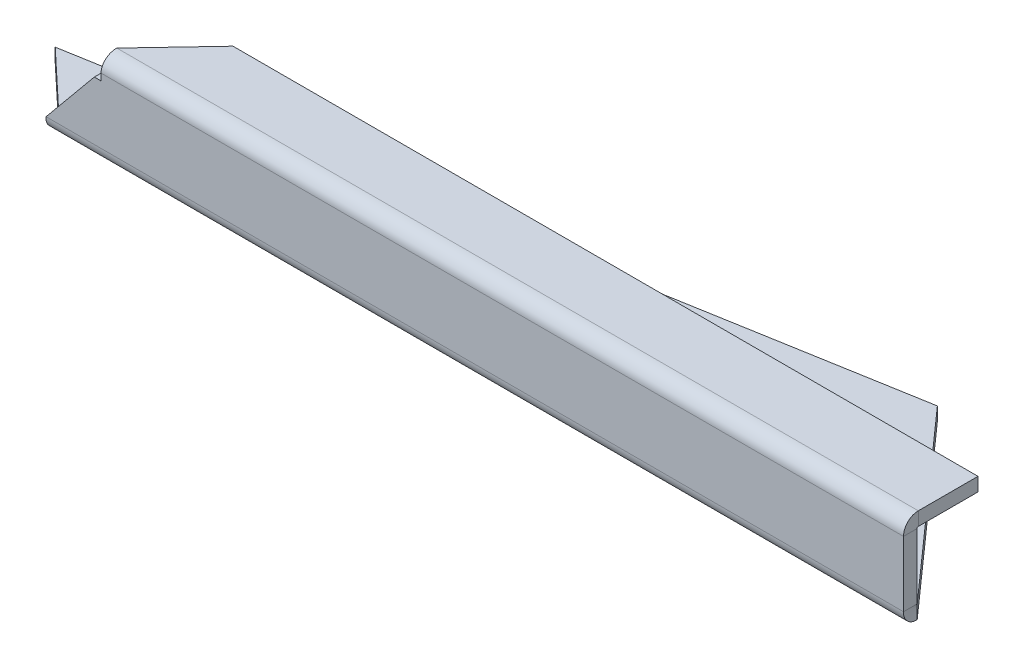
ISO-10303-21;
HEADER;
FILE_DESCRIPTION(('STEP AP214'),'2;1');
FILE_NAME('part.step','',(''),(''),'','','');
FILE_SCHEMA(('AUTOMOTIVE_DESIGN { 1 0 10303 214 1 1 1 1 }'));
ENDSEC;
DATA;
#1=APPLICATION_CONTEXT('core data for automotive mechanical design processes');
#2=APPLICATION_PROTOCOL_DEFINITION('international standard','automotive_design',2000,#1);
#3=PRODUCT_CONTEXT('',#1,'mechanical');
#4=PRODUCT('Part','Part','',(#3));
#5=PRODUCT_RELATED_PRODUCT_CATEGORY('part','',(#4));
#6=PRODUCT_DEFINITION_FORMATION('','',#4);
#7=PRODUCT_DEFINITION_CONTEXT('part definition',#1,'design');
#8=PRODUCT_DEFINITION('design','',#6,#7);
#9=PRODUCT_DEFINITION_SHAPE('','',#8);
#10=(LENGTH_UNIT() NAMED_UNIT(*) SI_UNIT(.MILLI.,.METRE.));
#11=(NAMED_UNIT(*) PLANE_ANGLE_UNIT() SI_UNIT($,.RADIAN.));
#12=(NAMED_UNIT(*) SI_UNIT($,.STERADIAN.) SOLID_ANGLE_UNIT());
#13=UNCERTAINTY_MEASURE_WITH_UNIT(LENGTH_MEASURE(1.E-05),#10,'distance_accuracy_value','');
#14=(GEOMETRIC_REPRESENTATION_CONTEXT(3) GLOBAL_UNCERTAINTY_ASSIGNED_CONTEXT((#13)) GLOBAL_UNIT_ASSIGNED_CONTEXT((#10,
#11,#12)) REPRESENTATION_CONTEXT('',''));
#15=CARTESIAN_POINT('',(0.,0.,0.));
#16=DIRECTION('',(0.,0.,1.));
#17=DIRECTION('',(1.,0.,0.));
#18=AXIS2_PLACEMENT_3D('',#15,#16,#17);
#19=CARTESIAN_POINT('',(-474.,40.,8.));
#20=DIRECTION('',(0.771373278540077,-0.636382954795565,0.));
#21=DIRECTION('',(0.636382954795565,0.771373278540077,0.));
#22=AXIS2_PLACEMENT_3D('',#19,#20,#21);
#23=PLANE('',#22);
#24=DIRECTION('',(0.,0.,1.));
#25=VECTOR('',#24,1.);
#26=CARTESIAN_POINT('',(-506.392305,0.736599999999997,0.));
#27=LINE('',#26,#25);
#28=CARTESIAN_POINT('',(-506.392305,0.736599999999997,0.));
#29=VERTEX_POINT('',#28);
#30=CARTESIAN_POINT('',(-506.392305,0.736600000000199,8.00000000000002));
#31=VERTEX_POINT('',#30);
#32=EDGE_CURVE('E175',#29,#31,#27,.T.);
#33=ORIENTED_EDGE('',*,*,#32,.T.);
#34=DIRECTION('',(-0.636382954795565,-0.771373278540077,0.));
#35=VECTOR('',#34,1.);
#36=CARTESIAN_POINT('',(-474.,40.,8.));
#37=LINE('',#36,#35);
#38=CARTESIAN_POINT('',(-477.907695,35.2634,8.));
#39=VERTEX_POINT('',#38);
#40=EDGE_CURVE('E38',#39,#31,#37,.T.);
#41=ORIENTED_EDGE('',*,*,#40,.F.);
#42=DIRECTION('',(0.,0.,1.));
#43=VECTOR('',#42,1.);
#44=CARTESIAN_POINT('',(-477.907695,35.2634,8.));
#45=LINE('',#44,#43);
#46=CARTESIAN_POINT('',(-477.907695,35.2634,0.));
#47=VERTEX_POINT('',#46);
#48=EDGE_CURVE('E330',#47,#39,#45,.T.);
#49=ORIENTED_EDGE('',*,*,#48,.F.);
#50=DIRECTION('',(-0.636382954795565,-0.771373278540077,0.));
#51=VECTOR('',#50,1.);
#52=CARTESIAN_POINT('',(-474.,40.,0.));
#53=LINE('',#52,#51);
#54=EDGE_CURVE('E329',#47,#29,#53,.T.);
#55=ORIENTED_EDGE('',*,*,#54,.T.);
#56=EDGE_LOOP('',(#33,#41,#49,#55));
#57=FACE_BOUND('',#56,.T.);
#58=ADVANCED_FACE('F31',(#57),#23,.F.);
#59=CARTESIAN_POINT('',(0.,0.,8.));
#60=DIRECTION('',(-1.,0.,0.));
#61=DIRECTION('',(0.,0.,1.));
#62=AXIS2_PLACEMENT_3D('',#59,#60,#61);
#63=PLANE('',#62);
#64=DIRECTION('',(0.,0.,1.));
#65=VECTOR('',#64,1.);
#66=CARTESIAN_POINT('',(0.,0.736600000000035,0.));
#67=LINE('',#66,#65);
#68=CARTESIAN_POINT('',(0.,0.736600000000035,0.));
#69=VERTEX_POINT('',#68);
#70=CARTESIAN_POINT('',(0.,0.736600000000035,8.));
#71=VERTEX_POINT('',#70);
#72=EDGE_CURVE('E172',#69,#71,#67,.T.);
#73=ORIENTED_EDGE('',*,*,#72,.F.);
#74=DIRECTION('',(0.,1.,0.));
#75=VECTOR('',#74,1.);
#76=CARTESIAN_POINT('',(0.,0.,0.));
#77=LINE('',#76,#75);
#78=CARTESIAN_POINT('',(0.,39.2634,0.));
#79=VERTEX_POINT('',#78);
#80=EDGE_CURVE('E314',#69,#79,#77,.T.);
#81=ORIENTED_EDGE('',*,*,#80,.T.);
#82=DIRECTION('',(0.,0.,1.));
#83=VECTOR('',#82,1.);
#84=CARTESIAN_POINT('',(0.,39.2634,0.));
#85=LINE('',#84,#83);
#86=CARTESIAN_POINT('',(0.,39.2634000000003,7.99999999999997));
#87=VERTEX_POINT('',#86);
#88=EDGE_CURVE('E355',#79,#87,#85,.T.);
#89=ORIENTED_EDGE('',*,*,#88,.T.);
#90=DIRECTION('',(0.,1.,0.));
#91=VECTOR('',#90,1.);
#92=CARTESIAN_POINT('',(0.,0.,8.));
#93=LINE('',#92,#91);
#94=EDGE_CURVE('E11',#71,#87,#93,.T.);
#95=ORIENTED_EDGE('',*,*,#94,.F.);
#96=EDGE_LOOP('',(#73,#81,#89,#95));
#97=FACE_BOUND('',#96,.T.);
#98=ADVANCED_FACE('F302',(#97),#63,.F.);
#99=CARTESIAN_POINT('',(-507.,0.,8.));
#100=DIRECTION('',(0.,0.,1.));
#101=DIRECTION('',(1.,0.,0.));
#102=AXIS2_PLACEMENT_3D('',#99,#100,#101);
#103=PLANE('',#102);
#104=ORIENTED_EDGE('',*,*,#40,.T.);
#105=DIRECTION('',(-1.,0.,0.));
#106=VECTOR('',#105,1.);
#107=CARTESIAN_POINT('',(-507.784122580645,0.736600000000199,8.00000000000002));
#108=LINE('',#107,#106);
#109=EDGE_CURVE('E168',#31,#71,#108,.F.);
#110=ORIENTED_EDGE('',*,*,#109,.T.);
#111=ORIENTED_EDGE('',*,*,#94,.T.);
#112=DIRECTION('',(1.,0.,0.));
#113=VECTOR('',#112,1.);
#114=CARTESIAN_POINT('',(0.,39.2634000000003,7.99999999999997));
#115=LINE('',#114,#113);
#116=CARTESIAN_POINT('',(-474.,39.2634,8.));
#117=VERTEX_POINT('',#116);
#118=EDGE_CURVE('E352',#87,#117,#115,.F.);
#119=ORIENTED_EDGE('',*,*,#118,.T.);
#120=DIRECTION('',(0.,-1.,0.));
#121=VECTOR('',#120,1.);
#122=CARTESIAN_POINT('',(-474.,0.,8.));
#123=LINE('',#122,#121);
#124=CARTESIAN_POINT('',(-474.,35.2634,8.));
#125=VERTEX_POINT('',#124);
#126=EDGE_CURVE('E333',#117,#125,#123,.T.);
#127=ORIENTED_EDGE('',*,*,#126,.T.);
#128=DIRECTION('',(-1.,0.,0.));
#129=VECTOR('',#128,1.);
#130=CARTESIAN_POINT('',(-507.,35.2634,8.));
#131=LINE('',#130,#129);
#132=EDGE_CURVE('E339',#125,#39,#131,.T.);
#133=ORIENTED_EDGE('',*,*,#132,.T.);
#134=EDGE_LOOP('',(#104,#110,#111,#119,#127,#133));
#135=FACE_BOUND('',#134,.T.);
#136=ADVANCED_FACE('F299',(#135),#103,.T.);
#137=CARTESIAN_POINT('',(-507.,0.,0.));
#138=DIRECTION('',(0.,0.,1.));
#139=DIRECTION('',(1.,0.,0.));
#140=AXIS2_PLACEMENT_3D('',#137,#138,#139);
#141=PLANE('',#140);
#142=DIRECTION('',(-1.,0.,0.));
#143=VECTOR('',#142,1.);
#144=CARTESIAN_POINT('',(-507.784122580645,0.736599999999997,0.));
#145=LINE('',#144,#143);
#146=EDGE_CURVE('E160',#29,#69,#145,.F.);
#147=ORIENTED_EDGE('',*,*,#146,.F.);
#148=ORIENTED_EDGE('',*,*,#54,.F.);
#149=DIRECTION('',(-1.,0.,0.));
#150=VECTOR('',#149,1.);
#151=CARTESIAN_POINT('',(-474.,35.2634,0.));
#152=LINE('',#151,#150);
#153=CARTESIAN_POINT('',(-474.,35.2634,0.));
#154=VERTEX_POINT('',#153);
#155=EDGE_CURVE('E343',#154,#47,#152,.T.);
#156=ORIENTED_EDGE('',*,*,#155,.F.);
#157=DIRECTION('',(0.,-1.,0.));
#158=VECTOR('',#157,1.);
#159=CARTESIAN_POINT('',(-474.,39.2634,0.));
#160=LINE('',#159,#158);
#161=CARTESIAN_POINT('',(-474.,39.2634,0.));
#162=VERTEX_POINT('',#161);
#163=EDGE_CURVE('E270',#162,#154,#160,.T.);
#164=ORIENTED_EDGE('',*,*,#163,.F.);
#165=DIRECTION('',(1.,0.,0.));
#166=VECTOR('',#165,1.);
#167=CARTESIAN_POINT('',(0.,39.2634,0.));
#168=LINE('',#167,#166);
#169=EDGE_CURVE('E265',#79,#162,#168,.F.);
#170=ORIENTED_EDGE('',*,*,#169,.F.);
#171=ORIENTED_EDGE('',*,*,#80,.F.);
#172=EDGE_LOOP('',(#147,#148,#156,#164,#170,#171));
#173=FACE_BOUND('',#172,.T.);
#174=ADVANCED_FACE('F292',(#173),#141,.F.);
#175=CARTESIAN_POINT('',(-474.,35.2634,0.));
#176=DIRECTION('',(0.,1.,0.));
#177=DIRECTION('',(0.,0.,1.));
#178=AXIS2_PLACEMENT_3D('',#175,#176,#177);
#179=PLANE('',#178);
#180=ORIENTED_EDGE('',*,*,#155,.T.);
#181=ORIENTED_EDGE('',*,*,#48,.T.);
#182=ORIENTED_EDGE('',*,*,#132,.F.);
#183=DIRECTION('',(0.,0.,1.));
#184=VECTOR('',#183,1.);
#185=CARTESIAN_POINT('',(-474.,35.2634,0.));
#186=LINE('',#185,#184);
#187=EDGE_CURVE('E341',#154,#125,#186,.T.);
#188=ORIENTED_EDGE('',*,*,#187,.F.);
#189=EDGE_LOOP('',(#180,#181,#182,#188));
#190=FACE_BOUND('',#189,.T.);
#191=ADVANCED_FACE('F289',(#190),#179,.T.);
#192=CARTESIAN_POINT('',(-474.,39.2634,0.));
#193=DIRECTION('',(-1.,0.,0.));
#194=DIRECTION('',(0.,0.,1.));
#195=AXIS2_PLACEMENT_3D('',#192,#193,#194);
#196=PLANE('',#195);
#197=ORIENTED_EDGE('',*,*,#126,.F.);
#198=DIRECTION('',(0.,0.,1.));
#199=VECTOR('',#198,1.);
#200=CARTESIAN_POINT('',(-474.,39.2634,0.));
#201=LINE('',#200,#199);
#202=EDGE_CURVE('E344',#162,#117,#201,.T.);
#203=ORIENTED_EDGE('',*,*,#202,.F.);
#204=ORIENTED_EDGE('',*,*,#163,.T.);
#205=ORIENTED_EDGE('',*,*,#187,.T.);
#206=EDGE_LOOP('',(#197,#203,#204,#205));
#207=FACE_BOUND('',#206,.T.);
#208=ADVANCED_FACE('F278',(#207),#196,.T.);
#209=CARTESIAN_POINT('',(-474.,39.2633999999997,8.07999999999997));
#210=CARTESIAN_POINT('',(-473.942016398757,40.4176978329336,8.08000000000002));
#211=CARTESIAN_POINT('',(-473.884053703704,41.5711263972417,7.85052750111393));
#212=CARTESIAN_POINT('',(-473.768107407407,43.7036071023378,6.96722507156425));
#213=CARTESIAN_POINT('',(-473.710134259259,44.6816126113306,6.3137426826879));
#214=CARTESIAN_POINT('',(-473.594187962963,46.3137426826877,4.68161261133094));
#215=CARTESIAN_POINT('',(-473.536214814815,46.9672250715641,3.70360710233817));
#216=CARTESIAN_POINT('',(-473.420268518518,47.8505275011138,1.57112639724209));
#217=CARTESIAN_POINT('',(-473.362305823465,48.0799999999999,0.417697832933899));
#218=CARTESIAN_POINT('',(-473.304322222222,48.0799999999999,-0.736599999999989));
#219=CARTESIAN_POINT('',(-474.,39.2633999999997,7.99999999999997));
#220=CARTESIAN_POINT('',(-473.942016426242,40.4072239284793,8.00000000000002));
#221=CARTESIAN_POINT('',(-473.884053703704,41.550186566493,7.77260968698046));
#222=CARTESIAN_POINT('',(-473.768107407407,43.6633175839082,6.89732216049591));
#223=CARTESIAN_POINT('',(-473.710134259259,44.6324488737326,6.24976933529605));
#224=CARTESIAN_POINT('',(-473.594187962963,46.2497693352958,4.63244887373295));
#225=CARTESIAN_POINT('',(-473.536214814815,46.8973221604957,3.66331758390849));
#226=CARTESIAN_POINT('',(-473.420268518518,47.7726096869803,1.55018656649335));
#227=CARTESIAN_POINT('',(-473.36230579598,48.,0.407223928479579));
#228=CARTESIAN_POINT('',(-473.304322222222,48.,-0.73659999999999));
#229=CARTESIAN_POINT('',(-474.,39.2634,0.));
#230=CARTESIAN_POINT('',(-473.942019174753,39.3598334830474,0.));
#231=CARTESIAN_POINT('',(-473.884053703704,39.456203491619,-0.0191717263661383));
#232=CARTESIAN_POINT('',(-473.768107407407,39.6343657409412,-0.0929689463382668));
#233=CARTESIAN_POINT('',(-473.710134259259,39.7160751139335,-0.147565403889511));
#234=CARTESIAN_POINT('',(-473.594187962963,39.8524345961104,-0.283924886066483));
#235=CARTESIAN_POINT('',(-473.536214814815,39.9070310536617,-0.365634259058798));
#236=CARTESIAN_POINT('',(-473.420268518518,39.9808282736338,-0.543796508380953));
#237=CARTESIAN_POINT('',(-473.362303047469,40.,-0.6401665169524));
#238=CARTESIAN_POINT('',(-473.304322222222,40.,-0.736599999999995));
#239=CARTESIAN_POINT('',(-474.,39.2634,-0.0808000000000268));
#240=CARTESIAN_POINT('',(-473.942019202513,39.3492548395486,-0.0808000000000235));
#241=CARTESIAN_POINT('',(-473.884053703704,39.4350542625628,-0.097868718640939));
#242=CARTESIAN_POINT('',(-473.768107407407,39.5936733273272,-0.163570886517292));
#243=CARTESIAN_POINT('',(-473.710134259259,39.6664197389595,-0.212178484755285));
#244=CARTESIAN_POINT('',(-473.594187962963,39.7878215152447,-0.333580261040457));
#245=CARTESIAN_POINT('',(-473.536214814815,39.8364291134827,-0.406326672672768));
#246=CARTESIAN_POINT('',(-473.420268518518,39.902131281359,-0.564945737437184));
#247=CARTESIAN_POINT('',(-473.362303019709,39.9192,-0.650745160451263));
#248=CARTESIAN_POINT('',(-473.304322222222,39.9192,-0.736599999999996));
#249=B_SPLINE_SURFACE_WITH_KNOTS('',1,3,((#209,#210,#211,#212,#213,#214,#215,#216,#217,#218),
(#219,#220,#221,#222,#223,#224,#225,#226,#227,#228),(#229,#230,#231,#232,#233,#234,#235,#236,
#237,#238),(#239,#240,#241,#242,#243,#244,#245,#246,#247,#248)),.UNSPECIFIED.,.F.,.F.,.F.,(2,1,
1,2),(4,2,2,2,4),(-0.01,0.,1.,1.0101),(0.,0.25,0.5,0.75,1.),.UNSPECIFIED.);
#250=DIRECTION('',(0.,1.,0.));
#251=VECTOR('',#250,1.);
#252=CARTESIAN_POINT('',(-473.304322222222,40.,-0.736599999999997));
#253=LINE('',#252,#251);
#254=CARTESIAN_POINT('',(-473.304322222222,40.,-0.736599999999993));
#255=VERTEX_POINT('',#254);
#256=CARTESIAN_POINT('',(-473.304322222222,48.,-0.736599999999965));
#257=VERTEX_POINT('',#256);
#258=EDGE_CURVE('E174',#255,#257,#253,.T.);
#259=CARTESIAN_POINT('',(-474.,39.2634,0.));
#260=CARTESIAN_POINT('',(-473.983783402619,39.290368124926,5.87050044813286E-07));
#261=CARTESIAN_POINT('',(-473.967578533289,39.3173199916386,-0.0014824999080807));
#262=CARTESIAN_POINT('',(-473.935169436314,39.3709002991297,-0.00738771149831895));
#263=CARTESIAN_POINT('',(-473.918965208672,39.3975287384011,-0.0118098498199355));
#264=CARTESIAN_POINT('',(-473.870417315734,39.4763333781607,-0.0294068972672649));
#265=CARTESIAN_POINT('',(-473.838040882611,39.5275950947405,-0.0469128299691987));
#266=CARTESIAN_POINT('',(-473.776567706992,39.6201555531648,-0.0903358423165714));
#267=CARTESIAN_POINT('',(-473.747467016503,39.6619379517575,-0.115235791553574));
#268=CARTESIAN_POINT('',(-473.689273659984,39.7398029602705,-0.172723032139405));
#269=CARTESIAN_POINT('',(-473.66018100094,39.7758892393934,-0.20530534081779));
#270=CARTESIAN_POINT('',(-473.602004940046,39.8409766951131,-0.276897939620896));
#271=CARTESIAN_POINT('',(-473.572921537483,39.8699787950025,-0.315907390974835));
#272=CARTESIAN_POINT('',(-473.514738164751,39.9197981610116,-0.398868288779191));
#273=CARTESIAN_POINT('',(-473.485638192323,39.940612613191,-0.442821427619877));
#274=CARTESIAN_POINT('',(-473.431165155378,39.9711399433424,-0.52812037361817));
#275=CARTESIAN_POINT('',(-473.405790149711,39.9819301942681,-0.569083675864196));
#276=CARTESIAN_POINT('',(-473.355053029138,39.996375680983,-0.6522256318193));
#277=CARTESIAN_POINT('',(-473.329690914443,40.0000346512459,-0.694403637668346));
#278=CARTESIAN_POINT('',(-473.304322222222,40.,-0.736599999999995));
#279=B_SPLINE_CURVE_WITH_KNOTS('',3,(#259,#260,#261,#262,#263,#264,#265,#266,#267,#268,#269,
#270,#271,#272,#273,#274,#275,#276,#277,#278),.UNSPECIFIED.,.F.,.F.,(4,2,2,2,2,2,2,2,2,4),(0.,
0.0943306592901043,0.188661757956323,0.376754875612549,0.546023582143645,0.715182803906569,
0.88431996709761,1.05351520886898,1.20112966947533,1.34866680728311),.UNSPECIFIED.);
#280=EDGE_CURVE('E257',#162,#255,#279,.T.);
#281=CARTESIAN_POINT('',(-474.,39.2633999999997,7.99999999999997));
#282=CARTESIAN_POINT('',(-473.987526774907,39.5094459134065,8.00002655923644));
#283=CARTESIAN_POINT('',(-473.975053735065,39.7554880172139,7.98960715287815));
#284=CARTESIAN_POINT('',(-473.950108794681,40.2458073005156,7.94806823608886));
#285=CARTESIAN_POINT('',(-473.937636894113,40.490084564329,7.91694972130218));
#286=CARTESIAN_POINT('',(-473.912703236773,40.9749573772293,7.83423568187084));
#287=CARTESIAN_POINT('',(-473.900241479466,41.2155555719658,7.78265566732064));
#288=CARTESIAN_POINT('',(-473.875317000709,41.6915432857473,7.65939485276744));
#289=CARTESIAN_POINT('',(-473.862854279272,41.9269328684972,7.5877142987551));
#290=CARTESIAN_POINT('',(-473.837922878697,42.3909407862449,7.424721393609));
#291=CARTESIAN_POINT('',(-473.82545419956,42.619555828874,7.33339966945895));
#292=CARTESIAN_POINT('',(-473.800516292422,43.0682720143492,7.13179417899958));
#293=CARTESIAN_POINT('',(-473.788047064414,43.2883729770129,7.02151001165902));
#294=CARTESIAN_POINT('',(-473.763112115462,43.7184467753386,6.78278923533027));
#295=CARTESIAN_POINT('',(-473.750646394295,43.9284214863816,6.65435600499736));
#296=CARTESIAN_POINT('',(-473.725714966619,44.3367889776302,6.38023775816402));
#297=CARTESIAN_POINT('',(-473.71324926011,44.5351818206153,6.23455283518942));
#298=CARTESIAN_POINT('',(-473.688316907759,44.9189696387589,5.92697152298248));
#299=CARTESIAN_POINT('',(-473.675850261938,45.1043648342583,5.76507540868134));
#300=CARTESIAN_POINT('',(-473.650917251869,45.4608399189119,5.42622336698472));
#301=CARTESIAN_POINT('',(-473.638450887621,45.6319198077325,5.2492674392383));
#302=CARTESIAN_POINT('',(-473.613515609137,45.9585791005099,4.88151847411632));
#303=CARTESIAN_POINT('',(-473.601046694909,46.1141552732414,4.69072256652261));
#304=CARTESIAN_POINT('',(-473.576110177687,46.4086552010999,4.29668970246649));
#305=CARTESIAN_POINT('',(-473.563642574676,46.5475792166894,4.09345294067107));
#306=CARTESIAN_POINT('',(-473.538703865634,46.8078155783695,3.67593839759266));
#307=CARTESIAN_POINT('',(-473.526232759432,46.9291240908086,3.46165822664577));
#308=CARTESIAN_POINT('',(-473.501290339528,47.1532261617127,3.02363249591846));
#309=CARTESIAN_POINT('',(-473.488819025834,47.2560200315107,2.79988709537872));
#310=CARTESIAN_POINT('',(-473.463881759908,47.4423191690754,2.34461931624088));
#311=CARTESIAN_POINT('',(-473.45141580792,47.5258335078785,2.11310065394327));
#312=CARTESIAN_POINT('',(-473.426489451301,47.6730192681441,1.64393590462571));
#313=CARTESIAN_POINT('',(-473.414029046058,47.7366955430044,1.4062913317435));
#314=CARTESIAN_POINT('',(-473.385348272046,47.8599210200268,0.854074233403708));
#315=CARTESIAN_POINT('',(-473.369125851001,47.912450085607,0.537890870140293));
#316=CARTESIAN_POINT('',(-473.344810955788,47.9649744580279,0.0611234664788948));
#317=CARTESIAN_POINT('',(-473.336713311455,47.9781043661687,-0.0981310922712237));
#318=CARTESIAN_POINT('',(-473.320518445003,47.995616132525,-0.417110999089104));
#319=CARTESIAN_POINT('',(-473.312421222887,47.9999985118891,-0.576836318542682));
#320=CARTESIAN_POINT('',(-473.304322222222,48.,-0.73659999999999));
#321=B_SPLINE_CURVE_WITH_KNOTS('',3,(#281,#282,#283,#284,#285,#286,#287,#288,#289,#290,#291,
#292,#293,#294,#295,#296,#297,#298,#299,#300,#301,#302,#303,#304,#305,#306,#307,#308,#309,#310,
#311,#312,#313,#314,#315,#316,#317,#318,#319,#320),.UNSPECIFIED.,.F.,.F.,(4,2,2,2,2,2,2,2,2,2,2,
2,2,2,2,2,2,2,2,4),(0.,0.738860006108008,1.47768447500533,2.21594997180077,2.95420643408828,
3.69281598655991,4.43144116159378,5.16992901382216,5.9084128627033,6.64688418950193,
7.38535553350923,8.12398046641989,8.86259384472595,9.60136772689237,10.3401291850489,
11.078542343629,11.8167747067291,12.7773671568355,13.257165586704,13.7369354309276),.UNSPECIFIED.);
#322=EDGE_CURVE('E53',#117,#257,#321,.T.);
#323=ORIENTED_EDGE('',*,*,#258,.F.);
#324=ORIENTED_EDGE('',*,*,#280,.F.);
#325=ORIENTED_EDGE('',*,*,#202,.T.);
#326=ORIENTED_EDGE('',*,*,#322,.T.);
#327=EDGE_LOOP('',(#323,#324,#325,#326));
#328=FACE_BOUND('',#327,.T.);
#329=ADVANCED_FACE('F272',(#328),#249,.F.);
#330=CARTESIAN_POINT('',(0.,39.2634,-0.736599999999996));
#331=DIRECTION('',(-1.,0.,0.));
#332=DIRECTION('',(0.,0.,1.));
#333=AXIS2_PLACEMENT_3D('',#330,#331,#332);
#334=PLANE('',#333);
#335=CARTESIAN_POINT('',(0.,39.2634,-0.736599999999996));
#336=DIRECTION('',(1.,0.,0.));
#337=DIRECTION('',(0.,0.,-1.));
#338=AXIS2_PLACEMENT_3D('',#335,#336,#337);
#339=CIRCLE('',#338,0.736599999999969);
#340=CARTESIAN_POINT('',(0.,40.,-0.736599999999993));
#341=VERTEX_POINT('',#340);
#342=EDGE_CURVE('E391',#341,#79,#339,.T.);
#343=ORIENTED_EDGE('',*,*,#342,.F.);
#344=DIRECTION('',(0.,1.,0.));
#345=VECTOR('',#344,1.);
#346=CARTESIAN_POINT('',(0.,40.,-0.73659999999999));
#347=LINE('',#346,#345);
#348=CARTESIAN_POINT('',(0.,48.,-0.736599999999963));
#349=VERTEX_POINT('',#348);
#350=EDGE_CURVE('E370',#341,#349,#347,.T.);
#351=ORIENTED_EDGE('',*,*,#350,.T.);
#352=CARTESIAN_POINT('',(0.,39.2634,-0.736599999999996));
#353=DIRECTION('',(1.,0.,0.));
#354=DIRECTION('',(0.,0.,-1.));
#355=AXIS2_PLACEMENT_3D('',#352,#353,#354);
#356=CIRCLE('',#355,8.73659999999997);
#357=EDGE_CURVE('E264',#349,#87,#356,.T.);
#358=ORIENTED_EDGE('',*,*,#357,.T.);
#359=ORIENTED_EDGE('',*,*,#88,.F.);
#360=EDGE_LOOP('',(#343,#351,#358,#359));
#361=FACE_BOUND('',#360,.T.);
#362=ADVANCED_FACE('F253',(#361),#334,.F.);
#363=CARTESIAN_POINT('',(0.,39.2634,-0.736599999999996));
#364=DIRECTION('',(1.,0.,0.));
#365=DIRECTION('',(0.,1.,0.));
#366=AXIS2_PLACEMENT_3D('',#363,#364,#365);
#367=CYLINDRICAL_SURFACE('',#366,8.73659999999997);
#368=ORIENTED_EDGE('',*,*,#118,.F.);
#369=ORIENTED_EDGE('',*,*,#357,.F.);
#370=DIRECTION('',(-1.,0.,0.));
#371=VECTOR('',#370,1.);
#372=CARTESIAN_POINT('',(0.,48.,-0.736599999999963));
#373=LINE('',#372,#371);
#374=EDGE_CURVE('E397',#349,#257,#373,.T.);
#375=ORIENTED_EDGE('',*,*,#374,.T.);
#376=ORIENTED_EDGE('',*,*,#322,.F.);
#377=EDGE_LOOP('',(#368,#369,#375,#376));
#378=FACE_BOUND('',#377,.T.);
#379=ADVANCED_FACE('F251',(#378),#367,.T.);
#380=CARTESIAN_POINT('',(0.,39.2634,-0.736599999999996));
#381=DIRECTION('',(1.,0.,0.));
#382=DIRECTION('',(0.,1.,0.));
#383=AXIS2_PLACEMENT_3D('',#380,#381,#382);
#384=CYLINDRICAL_SURFACE('',#383,0.736599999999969);
#385=ORIENTED_EDGE('',*,*,#169,.T.);
#386=ORIENTED_EDGE('',*,*,#280,.T.);
#387=DIRECTION('',(1.,0.,0.));
#388=VECTOR('',#387,1.);
#389=CARTESIAN_POINT('',(-473.304322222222,40.,-0.736599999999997));
#390=LINE('',#389,#388);
#391=EDGE_CURVE('E213',#255,#341,#390,.T.);
#392=ORIENTED_EDGE('',*,*,#391,.T.);
#393=ORIENTED_EDGE('',*,*,#342,.T.);
#394=EDGE_LOOP('',(#385,#386,#392,#393));
#395=FACE_BOUND('',#394,.T.);
#396=ADVANCED_FACE('F246',(#395),#384,.F.);
#397=CARTESIAN_POINT('',(0.,48.0000000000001,-35.9999999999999));
#398=DIRECTION('',(-1.,0.,0.));
#399=DIRECTION('',(0.,0.,1.));
#400=AXIS2_PLACEMENT_3D('',#397,#398,#399);
#401=PLANE('',#400);
#402=ORIENTED_EDGE('',*,*,#350,.F.);
#403=DIRECTION('',(0.,0.,-1.));
#404=VECTOR('',#403,1.);
#405=CARTESIAN_POINT('',(0.,40.0000000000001,-35.9999999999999));
#406=LINE('',#405,#404);
#407=CARTESIAN_POINT('',(0.,40.0000000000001,-35.9999999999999));
#408=VERTEX_POINT('',#407);
#409=EDGE_CURVE('E369',#341,#408,#406,.T.);
#410=ORIENTED_EDGE('',*,*,#409,.T.);
#411=DIRECTION('',(0.,-1.,0.));
#412=VECTOR('',#411,1.);
#413=CARTESIAN_POINT('',(0.,48.0000000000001,-35.9999999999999));
#414=LINE('',#413,#412);
#415=CARTESIAN_POINT('',(0.,48.0000000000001,-35.9999999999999));
#416=VERTEX_POINT('',#415);
#417=EDGE_CURVE('E388',#416,#408,#414,.T.);
#418=ORIENTED_EDGE('',*,*,#417,.F.);
#419=DIRECTION('',(0.,0.,-1.));
#420=VECTOR('',#419,1.);
#421=CARTESIAN_POINT('',(0.,48.0000000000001,-35.9999999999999));
#422=LINE('',#421,#420);
#423=EDGE_CURVE('E376',#349,#416,#422,.T.);
#424=ORIENTED_EDGE('',*,*,#423,.F.);
#425=EDGE_LOOP('',(#402,#410,#418,#424));
#426=FACE_BOUND('',#425,.T.);
#427=ADVANCED_FACE('F239',(#426),#401,.F.);
#428=CARTESIAN_POINT('',(-474.,48.,0.));
#429=DIRECTION('',(0.727013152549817,0.,0.686623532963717));
#430=DIRECTION('',(0.686623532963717,0.,-0.727013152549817));
#431=AXIS2_PLACEMENT_3D('',#428,#429,#430);
#432=PLANE('',#431);
#433=ORIENTED_EDGE('',*,*,#258,.T.);
#434=DIRECTION('',(-0.686623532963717,0.,0.727013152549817));
#435=VECTOR('',#434,1.);
#436=CARTESIAN_POINT('',(-474.,48.,0.));
#437=LINE('',#436,#435);
#438=CARTESIAN_POINT('',(-440.,48.0000000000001,-35.9999999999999));
#439=VERTEX_POINT('',#438);
#440=EDGE_CURVE('E385',#439,#257,#437,.T.);
#441=ORIENTED_EDGE('',*,*,#440,.F.);
#442=DIRECTION('',(0.,-1.,0.));
#443=VECTOR('',#442,1.);
#444=CARTESIAN_POINT('',(-440.,48.0000000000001,-35.9999999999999));
#445=LINE('',#444,#443);
#446=CARTESIAN_POINT('',(-440.,40.0000000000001,-35.9999999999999));
#447=VERTEX_POINT('',#446);
#448=EDGE_CURVE('E375',#439,#447,#445,.T.);
#449=ORIENTED_EDGE('',*,*,#448,.T.);
#450=DIRECTION('',(-0.686623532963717,0.,0.727013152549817));
#451=VECTOR('',#450,1.);
#452=CARTESIAN_POINT('',(-474.,40.,0.));
#453=LINE('',#452,#451);
#454=EDGE_CURVE('E368',#447,#255,#453,.T.);
#455=ORIENTED_EDGE('',*,*,#454,.T.);
#456=EDGE_LOOP('',(#433,#441,#449,#455));
#457=FACE_BOUND('',#456,.T.);
#458=ADVANCED_FACE('F235',(#457),#432,.F.);
#459=CARTESIAN_POINT('',(0.,48.,0.));
#460=DIRECTION('',(0.,-1.,0.));
#461=DIRECTION('',(0.,0.,-1.));
#462=AXIS2_PLACEMENT_3D('',#459,#460,#461);
#463=PLANE('',#462);
#464=ORIENTED_EDGE('',*,*,#374,.F.);
#465=ORIENTED_EDGE('',*,*,#423,.T.);
#466=DIRECTION('',(-1.,0.,0.));
#467=VECTOR('',#466,1.);
#468=CARTESIAN_POINT('',(-440.,48.0000000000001,-35.9999999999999));
#469=LINE('',#468,#467);
#470=EDGE_CURVE('E379',#416,#439,#469,.T.);
#471=ORIENTED_EDGE('',*,*,#470,.T.);
#472=ORIENTED_EDGE('',*,*,#440,.T.);
#473=EDGE_LOOP('',(#464,#465,#471,#472));
#474=FACE_BOUND('',#473,.T.);
#475=ADVANCED_FACE('F231',(#474),#463,.F.);
#476=CARTESIAN_POINT('',(0.,40.,0.));
#477=DIRECTION('',(0.,-1.,0.));
#478=DIRECTION('',(0.,0.,-1.));
#479=AXIS2_PLACEMENT_3D('',#476,#477,#478);
#480=PLANE('',#479);
#481=ORIENTED_EDGE('',*,*,#409,.F.);
#482=ORIENTED_EDGE('',*,*,#391,.F.);
#483=ORIENTED_EDGE('',*,*,#454,.F.);
#484=DIRECTION('',(-1.,0.,0.));
#485=VECTOR('',#484,1.);
#486=CARTESIAN_POINT('',(-440.,40.0000000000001,-35.9999999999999));
#487=LINE('',#486,#485);
#488=EDGE_CURVE('E377',#408,#447,#487,.T.);
#489=ORIENTED_EDGE('',*,*,#488,.F.);
#490=EDGE_LOOP('',(#481,#482,#483,#489));
#491=FACE_BOUND('',#490,.T.);
#492=ADVANCED_FACE('F221',(#491),#480,.T.);
#493=CARTESIAN_POINT('',(-440.,48.0000000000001,-35.9999999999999));
#494=DIRECTION('',(0.,0.,1.));
#495=DIRECTION('',(0.,-1.,0.));
#496=AXIS2_PLACEMENT_3D('',#493,#494,#495);
#497=PLANE('',#496);
#498=ORIENTED_EDGE('',*,*,#488,.T.);
#499=ORIENTED_EDGE('',*,*,#448,.F.);
#500=ORIENTED_EDGE('',*,*,#470,.F.);
#501=ORIENTED_EDGE('',*,*,#417,.T.);
#502=EDGE_LOOP('',(#498,#499,#500,#501));
#503=FACE_BOUND('',#502,.T.);
#504=ADVANCED_FACE('F230',(#503),#497,.F.);
#505=CARTESIAN_POINT('',(0.,0.736599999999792,8.08000000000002));
#506=CARTESIAN_POINT('',(-0.0545728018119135,-0.417697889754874,8.07999999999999));
#507=CARTESIAN_POINT('',(-0.109125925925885,-1.57112639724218,7.85052750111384));
#508=CARTESIAN_POINT('',(-0.218251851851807,-3.70360710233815,6.96722507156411));
#509=CARTESIAN_POINT('',(-0.272814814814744,-4.68161261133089,6.31374268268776));
#510=CARTESIAN_POINT('',(-0.381940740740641,-6.3137426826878,4.68161261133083));
#511=CARTESIAN_POINT('',(-0.436503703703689,-6.96722507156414,3.70360710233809));
#512=CARTESIAN_POINT('',(-0.545629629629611,-7.85052750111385,1.57112639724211));
#513=CARTESIAN_POINT('',(-0.600182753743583,-8.07999999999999,0.417697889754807));
#514=CARTESIAN_POINT('',(-0.654755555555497,-8.08,-0.736599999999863));
#515=CARTESIAN_POINT('',(0.,0.736599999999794,8.00000000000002));
#516=CARTESIAN_POINT('',(-0.0545727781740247,-0.407223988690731,7.99999999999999));
#517=CARTESIAN_POINT('',(-0.109125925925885,-1.55018656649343,7.77260968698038));
#518=CARTESIAN_POINT('',(-0.218251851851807,-3.66331758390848,6.89732216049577));
#519=CARTESIAN_POINT('',(-0.272814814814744,-4.63244887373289,6.24976933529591));
#520=CARTESIAN_POINT('',(-0.381940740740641,-6.24976933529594,4.63244887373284));
#521=CARTESIAN_POINT('',(-0.436503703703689,-6.8973221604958,3.66331758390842));
#522=CARTESIAN_POINT('',(-0.545629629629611,-7.77260968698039,1.55018656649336));
#523=CARTESIAN_POINT('',(-0.600182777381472,-7.99999999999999,0.407223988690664));
#524=CARTESIAN_POINT('',(-0.654755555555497,-8.,-0.736599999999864));
#525=CARTESIAN_POINT('',(0.,0.736599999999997,0.));
#526=CARTESIAN_POINT('',(-0.0545704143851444,0.640166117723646,0.));
#527=CARTESIAN_POINT('',(-0.109125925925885,0.543796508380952,-0.0191717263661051));
#528=CARTESIAN_POINT('',(-0.218251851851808,0.365634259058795,-0.0929689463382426));
#529=CARTESIAN_POINT('',(-0.272814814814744,0.283924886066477,-0.14756540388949));
#530=CARTESIAN_POINT('',(-0.381940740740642,0.147565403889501,-0.283924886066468));
#531=CARTESIAN_POINT('',(-0.43650370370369,0.0929689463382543,-0.365634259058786));
#532=CARTESIAN_POINT('',(-0.545629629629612,0.0191717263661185,-0.543796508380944));
#533=CARTESIAN_POINT('',(-0.600185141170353,0.,-0.640166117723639));
#534=CARTESIAN_POINT('',(-0.654755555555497,0.,-0.736599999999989));
#535=CARTESIAN_POINT('',(0.,0.736599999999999,-0.080799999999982));
#536=CARTESIAN_POINT('',(-0.0545703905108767,0.650744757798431,-0.0807999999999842));
#537=CARTESIAN_POINT('',(-0.109125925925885,0.564945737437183,-0.0978687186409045));
#538=CARTESIAN_POINT('',(-0.218251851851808,0.406326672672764,-0.163570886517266));
#539=CARTESIAN_POINT('',(-0.272814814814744,0.333580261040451,-0.212178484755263));
#540=CARTESIAN_POINT('',(-0.381940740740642,0.212178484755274,-0.333580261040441));
#541=CARTESIAN_POINT('',(-0.43650370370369,0.163570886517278,-0.406326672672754));
#542=CARTESIAN_POINT('',(-0.545629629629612,0.0978687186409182,-0.564945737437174));
#543=CARTESIAN_POINT('',(-0.600185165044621,0.0807999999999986,-0.650744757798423));
#544=CARTESIAN_POINT('',(-0.654755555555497,0.0807999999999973,-0.73659999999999));
#545=B_SPLINE_SURFACE_WITH_KNOTS('',1,3,((#505,#506,#507,#508,#509,#510,#511,#512,#513,#514),
(#515,#516,#517,#518,#519,#520,#521,#522,#523,#524),(#525,#526,#527,#528,#529,#530,#531,#532,
#533,#534),(#535,#536,#537,#538,#539,#540,#541,#542,#543,#544)),.UNSPECIFIED.,.F.,.F.,.F.,(2,1,
1,2),(4,2,2,2,4),(-0.01,0.,1.,1.0101),(0.,0.25,0.5,0.75,1.),.UNSPECIFIED.);
#546=DIRECTION('',(0.,-1.,0.));
#547=VECTOR('',#546,1.);
#548=CARTESIAN_POINT('',(-0.654755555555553,0.,-0.736599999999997));
#549=LINE('',#548,#547);
#550=CARTESIAN_POINT('',(-0.654755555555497,0.,-0.736599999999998));
#551=VERTEX_POINT('',#550);
#552=CARTESIAN_POINT('',(-0.654755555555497,-8.,-0.73659999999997));
#553=VERTEX_POINT('',#552);
#554=EDGE_CURVE('E525',#551,#553,#549,.T.);
#555=CARTESIAN_POINT('',(0.,0.736599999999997,0.));
#556=CARTESIAN_POINT('',(-0.0155204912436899,0.709174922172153,6.47869000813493E-06));
#557=CARTESIAN_POINT('',(-0.0310394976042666,0.681751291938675,-0.0015314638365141));
#558=CARTESIAN_POINT('',(-0.0620772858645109,0.627243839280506,-0.00764838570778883));
#559=CARTESIAN_POINT('',(-0.0775960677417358,0.600160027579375,-0.0122274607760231));
#560=CARTESIAN_POINT('',(-0.108600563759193,0.54673053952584,-0.0243652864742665));
#561=CARTESIAN_POINT('',(-0.124086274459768,0.520383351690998,-0.0319173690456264));
#562=CARTESIAN_POINT('',(-0.155051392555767,0.468702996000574,-0.0498976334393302));
#563=CARTESIAN_POINT('',(-0.170530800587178,0.443369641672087,-0.0603252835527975));
#564=CARTESIAN_POINT('',(-0.212980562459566,0.375704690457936,-0.0927063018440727));
#565=CARTESIAN_POINT('',(-0.239965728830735,0.334688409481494,-0.117474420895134));
#566=CARTESIAN_POINT('',(-0.293906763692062,0.258253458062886,-0.174428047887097));
#567=CARTESIAN_POINT('',(-0.320862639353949,0.222830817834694,-0.206608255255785));
#568=CARTESIAN_POINT('',(-0.374769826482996,0.15885513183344,-0.277190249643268));
#569=CARTESIAN_POINT('',(-0.401721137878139,0.130300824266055,-0.315590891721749));
#570=CARTESIAN_POINT('',(-0.455638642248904,0.0811187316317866,-0.397195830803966));
#571=CARTESIAN_POINT('',(-0.48260483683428,0.0604941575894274,-0.440402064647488));
#572=CARTESIAN_POINT('',(-0.533770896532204,0.0296371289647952,-0.525389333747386));
#573=CARTESIAN_POINT('',(-0.557971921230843,0.0185582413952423,-0.566865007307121));
#574=CARTESIAN_POINT('',(-0.60636542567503,0.00372230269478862,-0.651088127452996));
#575=CARTESIAN_POINT('',(-0.630557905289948,-3.74396121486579E-05,-0.693835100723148));
#576=CARTESIAN_POINT('',(-0.654755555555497,0.,-0.736599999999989));
#577=B_SPLINE_CURVE_WITH_KNOTS('',3,(#555,#556,#557,#558,#559,#560,#561,#562,#563,#564,#565,
#566,#567,#568,#569,#570,#571,#572,#573,#574,#575,#576),.UNSPECIFIED.,.F.,.F.,(4,2,2,2,2,2,2,2,
2,2,4),(0.,0.0944958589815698,0.188994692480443,0.28328277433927,0.377553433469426,
0.54168301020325,0.705695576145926,0.869677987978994,1.03372673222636,1.18101557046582,
1.32825024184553),.UNSPECIFIED.);
#578=EDGE_CURVE('E167',#69,#551,#577,.T.);
#579=CARTESIAN_POINT('',(0.,0.736599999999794,8.00000000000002));
#580=CARTESIAN_POINT('',(-0.0117377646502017,0.49059057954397,8.00002654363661));
#581=CARTESIAN_POINT('',(-0.0234753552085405,0.244584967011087,7.98961023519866));
#582=CARTESIAN_POINT('',(-0.0469494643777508,-0.245662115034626,7.94808362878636));
#583=CARTESIAN_POINT('',(-0.0586859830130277,-0.48990366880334,7.91697432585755));
#584=CARTESIAN_POINT('',(-0.0821494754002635,-0.974706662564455,7.8342846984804));
#585=CARTESIAN_POINT('',(-0.093876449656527,-1.21527074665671,7.78271987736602));
#586=CARTESIAN_POINT('',(-0.11733130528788,-1.69119254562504,7.65949521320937));
#587=CARTESIAN_POINT('',(-0.129059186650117,-1.92655032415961,7.58783561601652));
#588=CARTESIAN_POINT('',(-0.15252055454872,-2.39049760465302,7.42489011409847));
#589=CARTESIAN_POINT('',(-0.164254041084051,-2.61908381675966,7.33359484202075));
#590=CARTESIAN_POINT('',(-0.187721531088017,-3.06774605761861,7.13204735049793));
#591=CARTESIAN_POINT('',(-0.199455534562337,-3.28782190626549,7.0217947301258));
#592=CARTESIAN_POINT('',(-0.222920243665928,-3.71784987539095,6.7831416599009));
#593=CARTESIAN_POINT('',(-0.234650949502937,-3.92780386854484,6.65474458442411));
#594=CARTESIAN_POINT('',(-0.258112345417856,-4.33613487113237,6.38070274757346));
#595=CARTESIAN_POINT('',(-0.269843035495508,-4.53451194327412,6.23505807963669));
#596=CARTESIAN_POINT('',(-0.293305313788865,-4.91827391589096,5.92756060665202));
#597=CARTESIAN_POINT('',(-0.305036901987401,-5.10365902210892,5.76570805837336));
#598=CARTESIAN_POINT('',(-0.328499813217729,-5.46011983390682,5.42694596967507));
#599=CARTESIAN_POINT('',(-0.340231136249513,-5.6311955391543,5.25003642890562));
#600=CARTESIAN_POINT('',(-0.363696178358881,-5.95785267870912,4.88238245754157));
#601=CARTESIAN_POINT('',(-0.375429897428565,-6.1134308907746,4.69163516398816));
#602=CARTESIAN_POINT('',(-0.398896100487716,-6.40794152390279,4.29770091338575));
#603=CARTESIAN_POINT('',(-0.410628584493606,-6.54687420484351,4.09451415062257));
#604=CARTESIAN_POINT('',(-0.434096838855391,-6.8071346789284,3.67710033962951));
#605=CARTESIAN_POINT('',(-0.445832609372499,-6.92845865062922,3.46287090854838));
#606=CARTESIAN_POINT('',(-0.469304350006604,-7.15259866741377,3.02494645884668));
#607=CARTESIAN_POINT('',(-0.481040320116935,-7.25541502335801,2.80125159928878));
#608=CARTESIAN_POINT('',(-0.504507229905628,-7.44176633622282,2.3460834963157));
#609=CARTESIAN_POINT('',(-0.516238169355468,-7.52531033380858,2.11461395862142));
#610=CARTESIAN_POINT('',(-0.539694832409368,-7.67256240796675,1.64554556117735));
#611=CARTESIAN_POINT('',(-0.551420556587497,-7.73627532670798,1.40794821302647));
#612=CARTESIAN_POINT('',(-0.578426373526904,-7.85966650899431,0.855507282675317));
#613=CARTESIAN_POINT('',(-0.593708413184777,-7.91229088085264,0.53904347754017));
#614=CARTESIAN_POINT('',(-0.616613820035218,-7.96491069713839,0.0618479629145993));
#615=CARTESIAN_POINT('',(-0.624242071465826,-7.97806450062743,-0.0975507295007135));
#616=CARTESIAN_POINT('',(-0.639498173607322,-7.99560813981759,-0.416820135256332));
#617=CARTESIAN_POINT('',(-0.647126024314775,-7.9999985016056,-0.576690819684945));
#618=CARTESIAN_POINT('',(-0.654755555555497,-8.,-0.736599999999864));
#619=B_SPLINE_CURVE_WITH_KNOTS('',3,(#579,#580,#581,#582,#583,#584,#585,#586,#587,#588,#589,
#590,#591,#592,#593,#594,#595,#596,#597,#598,#599,#600,#601,#602,#603,#604,#605,#606,#607,#608,
#609,#610,#611,#612,#613,#614,#615,#616,#617,#618),.UNSPECIFIED.,.F.,.F.,(4,2,2,2,2,2,2,2,2,2,2,
2,2,2,2,2,2,2,2,4),(0.,0.738642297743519,1.47724907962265,2.21529713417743,2.95333615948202,
3.69172805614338,4.4301355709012,5.16840594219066,5.90667231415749,6.64492699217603,
7.38318168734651,8.12158956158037,8.85998590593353,9.59854225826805,10.3370862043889,
11.0752829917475,11.8132993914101,12.7746225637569,13.2547875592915,13.7349237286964),.UNSPECIFIED.);
#620=EDGE_CURVE('E45',#71,#553,#619,.T.);
#621=ORIENTED_EDGE('',*,*,#554,.F.);
#622=ORIENTED_EDGE('',*,*,#578,.F.);
#623=ORIENTED_EDGE('',*,*,#72,.T.);
#624=ORIENTED_EDGE('',*,*,#620,.T.);
#625=EDGE_LOOP('',(#621,#622,#623,#624));
#626=FACE_BOUND('',#625,.T.);
#627=ADVANCED_FACE('F189',(#626),#545,.F.);
#628=CARTESIAN_POINT('',(-507.784122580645,-8.08000000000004,-0.736599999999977));
#629=CARTESIAN_POINT('',(-507.668116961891,-8.08000000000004,0.417696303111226));
#630=CARTESIAN_POINT('',(-507.552152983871,-7.8505275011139,1.57112639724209));
#631=CARTESIAN_POINT('',(-507.320183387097,-6.96722507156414,3.70360710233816));
#632=CARTESIAN_POINT('',(-507.20419858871,-6.31374268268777,4.68161261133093));
#633=CARTESIAN_POINT('',(-506.972228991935,-4.68161261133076,6.3137426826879));
#634=CARTESIAN_POINT('',(-506.856244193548,-3.70360710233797,6.96722507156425));
#635=CARTESIAN_POINT('',(-506.624274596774,-1.57112639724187,7.85052750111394));
#636=CARTESIAN_POINT('',(-506.508310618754,-0.417696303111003,8.08000000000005));
#637=CARTESIAN_POINT('',(-506.392305,0.736600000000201,8.08000000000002));
#638=CARTESIAN_POINT('',(-507.784122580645,-8.00000000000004,-0.736599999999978));
#639=CARTESIAN_POINT('',(-507.66811708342,-8.00000000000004,0.407222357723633));
#640=CARTESIAN_POINT('',(-507.552152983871,-7.77260968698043,1.55018656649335));
#641=CARTESIAN_POINT('',(-507.320183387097,-6.89732216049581,3.66331758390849));
#642=CARTESIAN_POINT('',(-507.20419858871,-6.24976933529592,4.63244887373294));
#643=CARTESIAN_POINT('',(-506.972228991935,-4.63244887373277,6.24976933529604));
#644=CARTESIAN_POINT('',(-506.856244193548,-3.6633175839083,6.89732216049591));
#645=CARTESIAN_POINT('',(-506.624274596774,-1.55018656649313,7.77260968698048));
#646=CARTESIAN_POINT('',(-506.508310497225,-0.407222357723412,8.00000000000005));
#647=CARTESIAN_POINT('',(-506.392305,0.736600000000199,8.00000000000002));
#648=CARTESIAN_POINT('',(-507.784122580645,0.,-0.736599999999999));
#649=CARTESIAN_POINT('',(-507.668129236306,0.,-0.640172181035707));
#650=CARTESIAN_POINT('',(-507.552152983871,0.0191717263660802,-0.543796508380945));
#651=CARTESIAN_POINT('',(-507.320183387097,0.0929689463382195,-0.36563425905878));
#652=CARTESIAN_POINT('',(-507.20419858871,0.14756540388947,-0.28392488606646));
#653=CARTESIAN_POINT('',(-506.972228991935,0.283924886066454,-0.147565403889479));
#654=CARTESIAN_POINT('',(-506.856244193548,0.365634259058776,-0.0929689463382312));
#655=CARTESIAN_POINT('',(-506.624274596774,0.543796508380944,-0.0191717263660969));
#656=CARTESIAN_POINT('',(-506.508298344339,0.640172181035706,0.));
#657=CARTESIAN_POINT('',(-506.392305,0.736599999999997,0.));
#658=CARTESIAN_POINT('',(-507.784122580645,0.08079999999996,-0.736599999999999));
#659=CARTESIAN_POINT('',(-507.66812935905,0.0807999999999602,-0.650750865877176));
#660=CARTESIAN_POINT('',(-507.552152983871,0.09786871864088,-0.564945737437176));
#661=CARTESIAN_POINT('',(-507.320183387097,0.163570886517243,-0.40632667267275));
#662=CARTESIAN_POINT('',(-507.20419858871,0.212178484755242,-0.333580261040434));
#663=CARTESIAN_POINT('',(-506.972228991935,0.333580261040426,-0.212178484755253));
#664=CARTESIAN_POINT('',(-506.856244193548,0.406326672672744,-0.163570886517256));
#665=CARTESIAN_POINT('',(-506.624274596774,0.564945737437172,-0.0978687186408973));
#666=CARTESIAN_POINT('',(-506.508298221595,0.650750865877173,-0.0807999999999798));
#667=CARTESIAN_POINT('',(-506.392305,0.736599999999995,-0.080799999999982));
#668=B_SPLINE_SURFACE_WITH_KNOTS('',1,3,((#628,#629,#630,#631,#632,#633,#634,#635,#636,#637),
(#638,#639,#640,#641,#642,#643,#644,#645,#646,#647),(#648,#649,#650,#651,#652,#653,#654,#655,
#656,#657),(#658,#659,#660,#661,#662,#663,#664,#665,#666,#667)),.UNSPECIFIED.,.F.,.F.,.F.,(2,1,
1,2),(4,2,2,2,4),(-0.01,0.,1.,1.0101),(0.,0.25,0.5,0.75,1.),.UNSPECIFIED.);
#669=CARTESIAN_POINT('',(-507.784122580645,0.,-0.736599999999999));
#670=CARTESIAN_POINT('',(-507.745017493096,-1.31477309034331E-05,-0.704092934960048));
#671=CARTESIAN_POINT('',(-507.705915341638,0.00215140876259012,-0.67158743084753));
#672=CARTESIAN_POINT('',(-507.627716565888,0.0107400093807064,-0.607146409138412));
#673=CARTESIAN_POINT('',(-507.588619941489,0.0171635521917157,-0.575210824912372));
#674=CARTESIAN_POINT('',(-507.51056027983,0.0341443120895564,-0.512579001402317));
#675=CARTESIAN_POINT('',(-507.471597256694,0.0446869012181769,-0.481878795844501));
#676=CARTESIAN_POINT('',(-507.393682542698,0.0697094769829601,-0.422136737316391));
#677=CARTESIAN_POINT('',(-507.354730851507,0.0841893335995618,-0.393094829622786));
#678=CARTESIAN_POINT('',(-507.237511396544,0.133344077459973,-0.308954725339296));
#679=CARTESIAN_POINT('',(-507.159188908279,0.173663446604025,-0.257098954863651));
#680=CARTESIAN_POINT('',(-507.002549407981,0.266497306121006,-0.165792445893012));
#681=CARTESIAN_POINT('',(-506.924232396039,0.319010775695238,-0.126340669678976));
#682=CARTESIAN_POINT('',(-506.808235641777,0.403067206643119,-0.0790843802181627));
#683=CARTESIAN_POINT('',(-506.770498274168,0.431400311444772,-0.0654674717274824));
#684=CARTESIAN_POINT('',(-506.695013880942,0.489576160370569,-0.0419479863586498));
#685=CARTESIAN_POINT('',(-506.657266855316,0.519418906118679,-0.0320454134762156));
#686=CARTESIAN_POINT('',(-506.581654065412,0.580222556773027,-0.0161029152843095));
#687=CARTESIAN_POINT('',(-506.543788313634,0.611186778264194,-0.0100756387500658));
#688=CARTESIAN_POINT('',(-506.46805099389,0.673633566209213,-0.00201815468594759));
#689=CARTESIAN_POINT('',(-506.430179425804,0.705116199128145,1.15362296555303E-05));
#690=CARTESIAN_POINT('',(-506.392305,0.736599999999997,0.));
#691=B_SPLINE_CURVE_WITH_KNOTS('',3,(#669,#670,#671,#672,#673,#674,#675,#676,#677,#678,#679,
#680,#681,#682,#683,#684,#685,#686,#687,#688,#689,#690),.UNSPECIFIED.,.F.,.F.,(4,2,2,2,2,2,2,2,
2,2,4),(0.,0.152504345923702,0.304990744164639,0.45694046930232,0.608885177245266,
0.913984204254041,1.21905769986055,1.36626791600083,1.5134782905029,1.66116674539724,
1.80887428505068),.UNSPECIFIED.);
#692=CARTESIAN_POINT('',(-507.784122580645,0.,-0.736599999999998));
#693=VERTEX_POINT('',#692);
#694=EDGE_CURVE('E156',#693,#29,#691,.T.);
#695=DIRECTION('',(0.,-1.,0.));
#696=VECTOR('',#695,1.);
#697=CARTESIAN_POINT('',(-507.784122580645,0.,-0.736599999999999));
#698=LINE('',#697,#696);
#699=CARTESIAN_POINT('',(-507.784122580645,-8.,-0.736599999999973));
#700=VERTEX_POINT('',#699);
#701=EDGE_CURVE('E139',#693,#700,#698,.T.);
#702=CARTESIAN_POINT('',(-507.784122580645,-8.00000000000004,-0.736599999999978));
#703=CARTESIAN_POINT('',(-507.759070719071,-8.00002697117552,-0.4895965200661));
#704=CARTESIAN_POINT('',(-507.734019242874,-7.98952611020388,-0.242596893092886));
#705=CARTESIAN_POINT('',(-507.68391858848,-7.9476635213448,0.249616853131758));
#706=CARTESIAN_POINT('',(-507.65886941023,-7.91630280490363,0.494831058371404));
#707=CARTESIAN_POINT('',(-507.608791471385,-7.83294692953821,0.981535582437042));
#708=CARTESIAN_POINT('',(-507.583762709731,-7.78096745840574,1.22302858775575));
#709=CARTESIAN_POINT('',(-507.533703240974,-7.65675623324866,1.70074515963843));
#710=CARTESIAN_POINT('',(-507.508672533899,-7.58452472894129,1.93696879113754));
#711=CARTESIAN_POINT('',(-507.458599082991,-7.42028565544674,2.40256653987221));
#712=CARTESIAN_POINT('',(-507.433556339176,-7.32826856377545,2.63193729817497));
#713=CARTESIAN_POINT('',(-507.383469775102,-7.12513849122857,3.08206702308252));
#714=CARTESIAN_POINT('',(-507.358425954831,-7.01402510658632,3.30282580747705));
#715=CARTESIAN_POINT('',(-507.308345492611,-6.77352479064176,3.73409938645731));
#716=CARTESIAN_POINT('',(-507.283308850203,-6.6441413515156,3.94461612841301));
#717=CARTESIAN_POINT('',(-507.233235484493,-6.36801509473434,4.35393739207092));
#718=CARTESIAN_POINT('',(-507.208198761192,-6.22127237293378,4.55274197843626));
#719=CARTESIAN_POINT('',(-507.158124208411,-5.91148809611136,4.93720346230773));
#720=CARTESIAN_POINT('',(-507.133086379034,-5.74844728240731,5.12286095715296));
#721=CARTESIAN_POINT('',(-507.083011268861,-5.40723197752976,5.47970514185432));
#722=CARTESIAN_POINT('',(-507.057973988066,-5.22905748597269,5.65089183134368));
#723=CARTESIAN_POINT('',(-507.007894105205,-4.85881335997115,5.97760115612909));
#724=CARTESIAN_POINT('',(-506.982851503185,-4.66674066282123,6.13312032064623));
#725=CARTESIAN_POINT('',(-506.932768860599,-4.270118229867,6.4273318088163));
#726=CARTESIAN_POINT('',(-506.907728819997,-4.0655686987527,6.56602440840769));
#727=CARTESIAN_POINT('',(-506.857641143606,-3.64540979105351,6.82561947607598));
#728=CARTESIAN_POINT('',(-506.832593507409,-3.42979784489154,6.94651778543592));
#729=CARTESIAN_POINT('',(-506.78249804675,-2.98911432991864,7.16961458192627));
#730=CARTESIAN_POINT('',(-506.757450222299,-2.76404292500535,7.27181339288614));
#731=CARTESIAN_POINT('',(-506.707366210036,-2.30616082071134,7.45673298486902));
#732=CARTESIAN_POINT('',(-506.682330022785,-2.07335411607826,7.5394636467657));
#733=CARTESIAN_POINT('',(-506.632269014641,-1.60166382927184,7.68489815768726));
#734=CARTESIAN_POINT('',(-506.607244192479,-1.36278182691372,7.74760715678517));
#735=CARTESIAN_POINT('',(-506.550541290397,-0.816455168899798,7.86651766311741));
#736=CARTESIAN_POINT('',(-506.518859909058,-0.507638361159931,7.91657626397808));
#737=CARTESIAN_POINT('',(-506.471374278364,-0.0421109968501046,7.96662686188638));
#738=CARTESIAN_POINT('',(-506.455560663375,0.113360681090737,7.97913749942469));
#739=CARTESIAN_POINT('',(-506.423934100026,0.424743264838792,7.99582325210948));
#740=CARTESIAN_POINT('',(-506.408121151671,0.580654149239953,7.99999876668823));
#741=CARTESIAN_POINT('',(-506.392305,0.736600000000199,8.00000000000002));
#742=B_SPLINE_CURVE_WITH_KNOTS('',3,(#702,#703,#704,#705,#706,#707,#708,#709,#710,#711,#712,
#713,#714,#715,#716,#717,#718,#719,#720,#721,#722,#723,#724,#725,#726,#727,#728,#729,#730,#731,
#732,#733,#734,#735,#736,#737,#738,#739,#740,#741),.UNSPECIFIED.,.F.,.F.,(4,2,2,2,2,2,2,2,2,2,2,
2,2,2,2,2,2,2,2,4),(0.,0.74458451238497,1.48913292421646,2.23311592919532,2.97708976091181,
3.72142245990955,4.46577089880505,5.20997725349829,5.9541794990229,6.69834790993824,
7.44251633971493,8.18684926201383,8.93116997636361,9.67566437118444,10.4201458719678,
11.1642486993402,11.9081599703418,12.8494823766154,13.3196167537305,13.7897286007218),.UNSPECIFIED.);
#743=EDGE_CURVE('E171',#700,#31,#742,.T.);
#744=ORIENTED_EDGE('',*,*,#694,.F.);
#745=ORIENTED_EDGE('',*,*,#701,.T.);
#746=ORIENTED_EDGE('',*,*,#743,.T.);
#747=ORIENTED_EDGE('',*,*,#32,.F.);
#748=EDGE_LOOP('',(#744,#745,#746,#747));
#749=FACE_BOUND('',#748,.T.);
#750=ADVANCED_FACE('F198',(#749),#668,.F.);
#751=CARTESIAN_POINT('',(-507.784122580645,0.736599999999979,-0.736600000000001));
#752=DIRECTION('',(-1.,0.,0.));
#753=DIRECTION('',(0.,-1.,0.));
#754=AXIS2_PLACEMENT_3D('',#751,#752,#753);
#755=CYLINDRICAL_SURFACE('',#754,8.73660000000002);
#756=ORIENTED_EDGE('',*,*,#109,.F.);
#757=ORIENTED_EDGE('',*,*,#743,.F.);
#758=DIRECTION('',(-1.,0.,0.));
#759=VECTOR('',#758,1.);
#760=CARTESIAN_POINT('',(-540.,-8.,-0.736599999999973));
#761=LINE('',#760,#759);
#762=EDGE_CURVE('E143',#553,#700,#761,.T.);
#763=ORIENTED_EDGE('',*,*,#762,.F.);
#764=ORIENTED_EDGE('',*,*,#620,.F.);
#765=EDGE_LOOP('',(#756,#757,#763,#764));
#766=FACE_BOUND('',#765,.T.);
#767=ADVANCED_FACE('F193',(#766),#755,.T.);
#768=CARTESIAN_POINT('',(-507.784122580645,0.736599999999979,-0.736600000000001));
#769=DIRECTION('',(-1.,0.,0.));
#770=DIRECTION('',(0.,-1.,0.));
#771=AXIS2_PLACEMENT_3D('',#768,#769,#770);
#772=CYLINDRICAL_SURFACE('',#771,0.736600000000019);
#773=ORIENTED_EDGE('',*,*,#146,.T.);
#774=ORIENTED_EDGE('',*,*,#578,.T.);
#775=DIRECTION('',(-1.,0.,0.));
#776=VECTOR('',#775,1.);
#777=CARTESIAN_POINT('',(-0.654755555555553,0.,-0.736599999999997));
#778=LINE('',#777,#776);
#779=EDGE_CURVE('E527',#551,#693,#778,.T.);
#780=ORIENTED_EDGE('',*,*,#779,.T.);
#781=ORIENTED_EDGE('',*,*,#694,.T.);
#782=EDGE_LOOP('',(#773,#774,#780,#781));
#783=FACE_BOUND('',#782,.T.);
#784=ADVANCED_FACE('F197',(#783),#772,.F.);
#785=CARTESIAN_POINT('',(-540.,-8.00000000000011,-31.));
#786=DIRECTION('',(0.684675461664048,0.,-0.728848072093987));
#787=DIRECTION('',(-0.728848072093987,0.,-0.684675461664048));
#788=AXIS2_PLACEMENT_3D('',#785,#786,#787);
#789=PLANE('',#788);
#790=ORIENTED_EDGE('',*,*,#701,.F.);
#791=DIRECTION('',(-0.728848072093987,0.,-0.684675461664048));
#792=VECTOR('',#791,1.);
#793=CARTESIAN_POINT('',(-540.,-1.08235984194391E-13,-31.));
#794=LINE('',#793,#792);
#795=CARTESIAN_POINT('',(-540.,-1.08235984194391E-13,-31.));
#796=VERTEX_POINT('',#795);
#797=EDGE_CURVE('E132',#693,#796,#794,.T.);
#798=ORIENTED_EDGE('',*,*,#797,.T.);
#799=DIRECTION('',(0.,1.,0.));
#800=VECTOR('',#799,1.);
#801=CARTESIAN_POINT('',(-540.,-8.00000000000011,-31.));
#802=LINE('',#801,#800);
#803=CARTESIAN_POINT('',(-540.,-8.00000000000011,-31.));
#804=VERTEX_POINT('',#803);
#805=EDGE_CURVE('E137',#804,#796,#802,.T.);
#806=ORIENTED_EDGE('',*,*,#805,.F.);
#807=DIRECTION('',(-0.728848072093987,0.,-0.684675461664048));
#808=VECTOR('',#807,1.);
#809=CARTESIAN_POINT('',(-540.,-8.00000000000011,-31.));
#810=LINE('',#809,#808);
#811=EDGE_CURVE('E519',#700,#804,#810,.T.);
#812=ORIENTED_EDGE('',*,*,#811,.F.);
#813=EDGE_LOOP('',(#790,#798,#806,#812));
#814=FACE_BOUND('',#813,.T.);
#815=ADVANCED_FACE('F134',(#814),#789,.F.);
#816=CARTESIAN_POINT('',(0.,-8.,0.));
#817=DIRECTION('',(-0.74740931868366,0.,0.66436383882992));
#818=DIRECTION('',(0.66436383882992,0.,0.74740931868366));
#819=AXIS2_PLACEMENT_3D('',#816,#817,#818);
#820=PLANE('',#819);
#821=ORIENTED_EDGE('',*,*,#554,.T.);
#822=DIRECTION('',(0.66436383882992,0.,0.74740931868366));
#823=VECTOR('',#822,1.);
#824=CARTESIAN_POINT('',(0.,-8.,0.));
#825=LINE('',#824,#823);
#826=CARTESIAN_POINT('',(-96.,-8.00000000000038,-108.));
#827=VERTEX_POINT('',#826);
#828=EDGE_CURVE('E162',#827,#553,#825,.T.);
#829=ORIENTED_EDGE('',*,*,#828,.F.);
#830=DIRECTION('',(0.,1.,0.));
#831=VECTOR('',#830,1.);
#832=CARTESIAN_POINT('',(-96.,-8.00000000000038,-108.));
#833=LINE('',#832,#831);
#834=CARTESIAN_POINT('',(-96.,-3.77080202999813E-13,-108.));
#835=VERTEX_POINT('',#834);
#836=EDGE_CURVE('E157',#827,#835,#833,.T.);
#837=ORIENTED_EDGE('',*,*,#836,.T.);
#838=DIRECTION('',(0.66436383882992,0.,0.74740931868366));
#839=VECTOR('',#838,1.);
#840=CARTESIAN_POINT('',(0.,0.,0.));
#841=LINE('',#840,#839);
#842=EDGE_CURVE('E148',#835,#551,#841,.T.);
#843=ORIENTED_EDGE('',*,*,#842,.T.);
#844=EDGE_LOOP('',(#821,#829,#837,#843));
#845=FACE_BOUND('',#844,.T.);
#846=ADVANCED_FACE('F481',(#845),#820,.F.);
#847=CARTESIAN_POINT('',(-540.,-8.00000000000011,-31.));
#848=DIRECTION('',(0.,-1.,0.));
#849=DIRECTION('',(0.,0.,-1.));
#850=AXIS2_PLACEMENT_3D('',#847,#848,#849);
#851=PLANE('',#850);
#852=ORIENTED_EDGE('',*,*,#828,.T.);
#853=ORIENTED_EDGE('',*,*,#762,.T.);
#854=ORIENTED_EDGE('',*,*,#811,.T.);
#855=DIRECTION('',(0.98529307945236,0.,-0.170872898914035));
#856=VECTOR('',#855,1.);
#857=CARTESIAN_POINT('',(-96.,-8.00000000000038,-108.));
#858=LINE('',#857,#856);
#859=EDGE_CURVE('E155',#804,#827,#858,.T.);
#860=ORIENTED_EDGE('',*,*,#859,.T.);
#861=EDGE_LOOP('',(#852,#853,#854,#860));
#862=FACE_BOUND('',#861,.T.);
#863=ADVANCED_FACE('F489',(#862),#851,.T.);
#864=CARTESIAN_POINT('',(-540.,-1.08235984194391E-13,-31.));
#865=DIRECTION('',(0.,-1.,0.));
#866=DIRECTION('',(0.,0.,-1.));
#867=AXIS2_PLACEMENT_3D('',#864,#865,#866);
#868=PLANE('',#867);
#869=ORIENTED_EDGE('',*,*,#779,.F.);
#870=ORIENTED_EDGE('',*,*,#842,.F.);
#871=DIRECTION('',(0.98529307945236,0.,-0.170872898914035));
#872=VECTOR('',#871,1.);
#873=CARTESIAN_POINT('',(-96.,-3.77080202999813E-13,-108.));
#874=LINE('',#873,#872);
#875=EDGE_CURVE('E142',#796,#835,#874,.T.);
#876=ORIENTED_EDGE('',*,*,#875,.F.);
#877=ORIENTED_EDGE('',*,*,#797,.F.);
#878=EDGE_LOOP('',(#869,#870,#876,#877));
#879=FACE_BOUND('',#878,.T.);
#880=ADVANCED_FACE('F146',(#879),#868,.F.);
#881=CARTESIAN_POINT('',(-96.,-8.00000000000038,-108.));
#882=DIRECTION('',(0.170872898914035,0.,0.98529307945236));
#883=DIRECTION('',(0.98529307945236,0.,-0.170872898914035));
#884=AXIS2_PLACEMENT_3D('',#881,#882,#883);
#885=PLANE('',#884);
#886=ORIENTED_EDGE('',*,*,#875,.T.);
#887=ORIENTED_EDGE('',*,*,#836,.F.);
#888=ORIENTED_EDGE('',*,*,#859,.F.);
#889=ORIENTED_EDGE('',*,*,#805,.T.);
#890=EDGE_LOOP('',(#886,#887,#888,#889));
#891=FACE_BOUND('',#890,.T.);
#892=ADVANCED_FACE('F154',(#891),#885,.F.);
#893=CLOSED_SHELL('',(#58,#98,#136,#174,#191,#208,#329,#362,#379,#396,#427,#458,#475,#492,#504,
#627,#750,#767,#784,#815,#846,#863,#880,#892));
#894=MANIFOLD_SOLID_BREP('B2',#893);
#895=ADVANCED_BREP_SHAPE_REPRESENTATION('',(#18,#894),#14);
#896=SHAPE_DEFINITION_REPRESENTATION(#9,#895);
ENDSEC;
END-ISO-10303-21;
